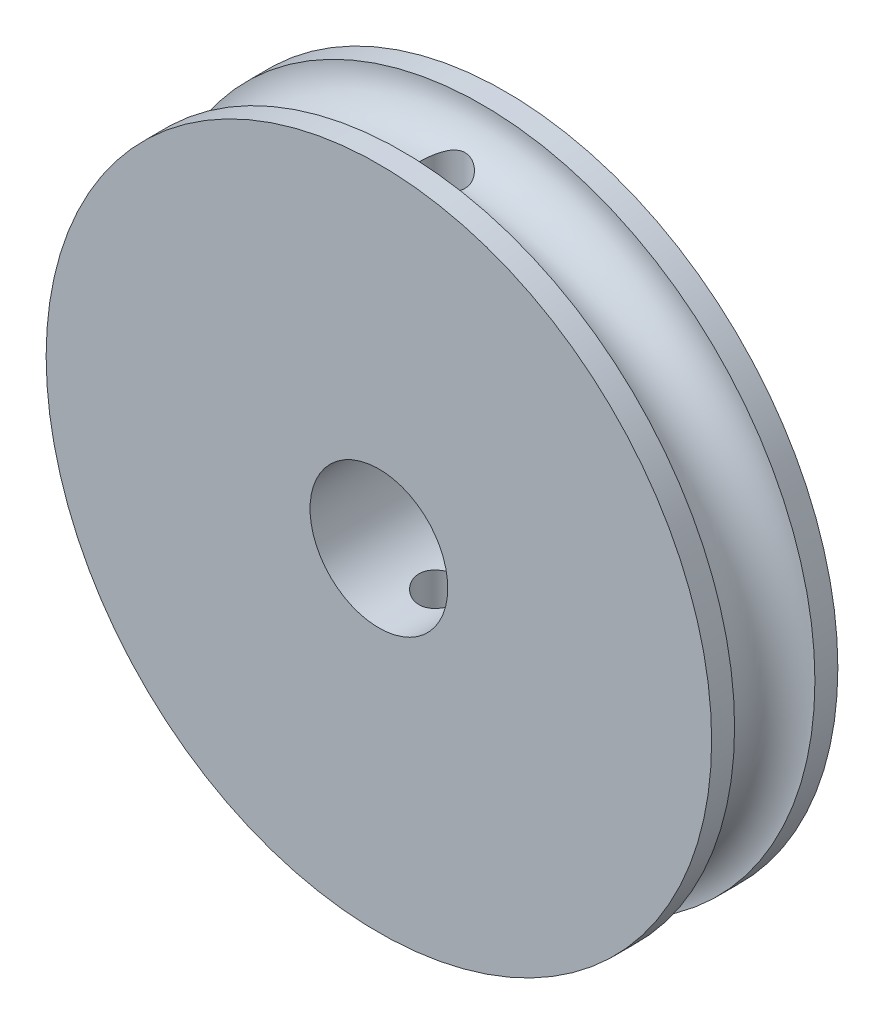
ISO-10303-21;
HEADER;
FILE_DESCRIPTION(('STEP AP214'),'2;1');
FILE_NAME('part.step','',(''),(''),'','','');
FILE_SCHEMA(('AUTOMOTIVE_DESIGN { 1 0 10303 214 1 1 1 1 }'));
ENDSEC;
DATA;
#1=APPLICATION_CONTEXT('core data for automotive mechanical design processes');
#2=APPLICATION_PROTOCOL_DEFINITION('international standard','automotive_design',2000,#1);
#3=PRODUCT_CONTEXT('',#1,'mechanical');
#4=PRODUCT('Part','Part','',(#3));
#5=PRODUCT_RELATED_PRODUCT_CATEGORY('part','',(#4));
#6=PRODUCT_DEFINITION_FORMATION('','',#4);
#7=PRODUCT_DEFINITION_CONTEXT('part definition',#1,'design');
#8=PRODUCT_DEFINITION('design','',#6,#7);
#9=PRODUCT_DEFINITION_SHAPE('','',#8);
#10=(LENGTH_UNIT() NAMED_UNIT(*) SI_UNIT(.MILLI.,.METRE.));
#11=(NAMED_UNIT(*) PLANE_ANGLE_UNIT() SI_UNIT($,.RADIAN.));
#12=(NAMED_UNIT(*) SI_UNIT($,.STERADIAN.) SOLID_ANGLE_UNIT());
#13=UNCERTAINTY_MEASURE_WITH_UNIT(LENGTH_MEASURE(1.E-05),#10,'distance_accuracy_value','');
#14=(GEOMETRIC_REPRESENTATION_CONTEXT(3) GLOBAL_UNCERTAINTY_ASSIGNED_CONTEXT((#13)) GLOBAL_UNIT_ASSIGNED_CONTEXT((#10,
#11,#12)) REPRESENTATION_CONTEXT('',''));
#15=CARTESIAN_POINT('',(0.,0.,0.));
#16=DIRECTION('',(0.,0.,1.));
#17=DIRECTION('',(1.,0.,0.));
#18=AXIS2_PLACEMENT_3D('',#15,#16,#17);
#19=CARTESIAN_POINT('',(0.,-14.5,2.75));
#20=DIRECTION('',(0.,1.,0.));
#21=DIRECTION('',(0.,0.,1.));
#22=AXIS2_PLACEMENT_3D('',#19,#20,#21);
#23=CYLINDRICAL_SURFACE('',#22,1.);
#24=CARTESIAN_POINT('',(-0.787959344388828,12.837738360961,2.13427270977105));
#25=CARTESIAN_POINT('',(-0.752155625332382,12.8571922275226,2.08845557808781));
#26=CARTESIAN_POINT('',(-0.712533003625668,12.8776655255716,2.04598242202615));
#27=CARTESIAN_POINT('',(-0.626420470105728,12.9185715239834,1.96835150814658));
#28=CARTESIAN_POINT('',(-0.579907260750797,12.9390038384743,1.93321958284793));
#29=CARTESIAN_POINT('',(-0.480481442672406,12.9775439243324,1.87102811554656));
#30=CARTESIAN_POINT('',(-0.427538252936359,12.9956396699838,1.84400945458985));
#31=CARTESIAN_POINT('',(-0.316463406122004,13.026650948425,1.79952570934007));
#32=CARTESIAN_POINT('',(-0.25835032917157,13.039584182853,1.7820279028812));
#33=CARTESIAN_POINT('',(-0.154707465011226,13.0553638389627,1.76102445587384));
#34=CARTESIAN_POINT('',(-0.109946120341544,13.059978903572,1.75503401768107));
#35=CARTESIAN_POINT('',(-0.0197905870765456,13.0644891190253,1.74917832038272));
#36=CARTESIAN_POINT('',(0.0256032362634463,13.0643868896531,1.7493096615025));
#37=CARTESIAN_POINT('',(0.11563531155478,13.0594795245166,1.75568365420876));
#38=CARTESIAN_POINT('',(0.160274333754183,13.0546795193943,1.76191963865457));
#39=CARTESIAN_POINT('',(0.247722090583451,13.0410174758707,1.7801378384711));
#40=CARTESIAN_POINT('',(0.290529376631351,13.0321522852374,1.79212451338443));
#41=CARTESIAN_POINT('',(0.375616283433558,13.0108138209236,1.82207190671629));
#42=CARTESIAN_POINT('',(0.417757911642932,12.9981797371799,1.84030587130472));
#43=CARTESIAN_POINT('',(0.498605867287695,12.9707407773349,1.8819772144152));
#44=CARTESIAN_POINT('',(0.537310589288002,12.9559348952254,1.90541700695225));
#45=CARTESIAN_POINT('',(0.61837527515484,12.9222174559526,1.96226191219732));
#46=CARTESIAN_POINT('',(0.659903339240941,12.9030792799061,1.99672319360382));
#47=CARTESIAN_POINT('',(0.737013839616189,12.8651248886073,2.07197585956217));
#48=CARTESIAN_POINT('',(0.772589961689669,12.846309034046,2.1127738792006));
#49=CARTESIAN_POINT('',(0.840322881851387,12.8088817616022,2.20462648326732));
#50=CARTESIAN_POINT('',(0.871767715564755,12.7904843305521,2.25630149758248));
#51=CARTESIAN_POINT('',(0.925181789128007,12.7583289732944,2.36564809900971));
#52=CARTESIAN_POINT('',(0.947163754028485,12.7445648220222,2.42331150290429));
#53=CARTESIAN_POINT('',(0.978367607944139,12.7247658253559,2.5359671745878));
#54=CARTESIAN_POINT('',(0.988763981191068,12.7180254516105,2.59050705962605));
#55=CARTESIAN_POINT('',(1.00033326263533,12.710515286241,2.70094517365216));
#56=CARTESIAN_POINT('',(1.00151526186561,12.7097396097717,2.75684200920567));
#57=CARTESIAN_POINT('',(0.995074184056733,12.7139300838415,2.86014755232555));
#58=CARTESIAN_POINT('',(0.988636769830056,12.7181231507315,2.90766875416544));
#59=CARTESIAN_POINT('',(0.969209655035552,12.7305920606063,3.00078855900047));
#60=CARTESIAN_POINT('',(0.956218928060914,12.7388685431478,3.04638685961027));
#61=CARTESIAN_POINT('',(0.923930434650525,12.7589834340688,3.1355511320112));
#62=CARTESIAN_POINT('',(0.904507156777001,12.7708923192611,3.17905514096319));
#63=CARTESIAN_POINT('',(0.860114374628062,12.7972492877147,3.26227947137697));
#64=CARTESIAN_POINT('',(0.835143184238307,12.811698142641,3.30199863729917));
#65=CARTESIAN_POINT('',(0.776298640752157,12.844307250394,3.38261112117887));
#66=CARTESIAN_POINT('',(0.741661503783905,12.8627024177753,3.42285184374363));
#67=CARTESIAN_POINT('',(0.666553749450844,12.899921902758,3.49733469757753));
#68=CARTESIAN_POINT('',(0.626074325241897,12.9187468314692,3.53156759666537));
#69=CARTESIAN_POINT('',(0.53460340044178,12.9573090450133,3.59719528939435));
#70=CARTESIAN_POINT('',(0.482932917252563,12.9768826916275,3.62775030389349));
#71=CARTESIAN_POINT('',(0.373778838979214,13.011675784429,3.67946995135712));
#72=CARTESIAN_POINT('',(0.316308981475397,13.0269052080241,3.70065616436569));
#73=CARTESIAN_POINT('',(0.213250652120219,13.0470749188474,3.72803333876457));
#74=CARTESIAN_POINT('',(0.168653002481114,13.0536840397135,3.73673025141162));
#75=CARTESIAN_POINT('',(0.0782657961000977,13.0622736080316,3.74796899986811));
#76=CARTESIAN_POINT('',(0.0324775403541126,13.0642589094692,3.75051729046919));
#77=CARTESIAN_POINT('',(-0.058998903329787,13.0633238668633,3.74930685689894));
#78=CARTESIAN_POINT('',(-0.104686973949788,13.0603993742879,3.74554279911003));
#79=CARTESIAN_POINT('',(-0.194632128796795,13.0500498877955,3.73193237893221));
#80=CARTESIAN_POINT('',(-0.238888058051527,13.0426213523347,3.72208123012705));
#81=CARTESIAN_POINT('',(-0.325374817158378,13.0240904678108,3.69667035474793));
#82=CARTESIAN_POINT('',(-0.367581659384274,13.0129529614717,3.68105583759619));
#83=CARTESIAN_POINT('',(-0.448907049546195,12.9881538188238,3.64468954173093));
#84=CARTESIAN_POINT('',(-0.488024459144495,12.9744912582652,3.62393588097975));
#85=CARTESIAN_POINT('',(-0.569876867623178,12.943027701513,3.57338955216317));
#86=CARTESIAN_POINT('',(-0.611902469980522,12.9249321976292,3.5426303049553));
#87=CARTESIAN_POINT('',(-0.690648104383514,12.8883959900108,3.47505280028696));
#88=CARTESIAN_POINT('',(-0.727362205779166,12.8699549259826,3.43822786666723));
#89=CARTESIAN_POINT('',(-0.799663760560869,12.8317561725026,3.35337769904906));
#90=CARTESIAN_POINT('',(-0.83436450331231,12.8121787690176,3.30450548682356));
#91=CARTESIAN_POINT('',(-0.894900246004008,12.7767931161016,3.20030466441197));
#92=CARTESIAN_POINT('',(-0.920742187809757,12.7609819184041,3.14498115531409));
#93=CARTESIAN_POINT('',(-0.960518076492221,12.7361782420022,3.03390322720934));
#94=CARTESIAN_POINT('',(-0.975234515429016,12.7267440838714,2.9785317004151));
#95=CARTESIAN_POINT('',(-0.994966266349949,12.7140234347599,2.86542892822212));
#96=CARTESIAN_POINT('',(-0.999995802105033,12.7107279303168,2.80770126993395));
#97=CARTESIAN_POINT('',(-1.00000355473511,12.7107203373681,2.70113859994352));
#98=CARTESIAN_POINT('',(-0.996403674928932,12.7130769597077,2.65229620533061));
#99=CARTESIAN_POINT('',(-0.982217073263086,12.7222529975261,2.55605343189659));
#100=CARTESIAN_POINT('',(-0.971627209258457,12.7290744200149,2.50865371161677));
#101=CARTESIAN_POINT('',(-0.944191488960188,12.7464023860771,2.41720426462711));
#102=CARTESIAN_POINT('',(-0.927436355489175,12.756855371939,2.37311660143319));
#103=CARTESIAN_POINT('',(-0.888315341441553,12.7805936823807,2.2884051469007));
#104=CARTESIAN_POINT('',(-0.865956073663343,12.7938756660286,2.24777734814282));
#105=CARTESIAN_POINT('',(-0.824486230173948,12.817600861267,2.18328206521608));
#106=CARTESIAN_POINT('',(-0.806748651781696,12.8275292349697,2.15831692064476));
#107=CARTESIAN_POINT('',(-0.787959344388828,12.837738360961,2.13427270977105));
#108=B_SPLINE_CURVE_WITH_KNOTS('',3,(#24,#25,#26,#27,#28,#29,#30,#31,#32,#33,#34,#35,#36,#37,
#38,#39,#40,#41,#42,#43,#44,#45,#46,#47,#48,#49,#50,#51,#52,#53,#54,#55,#56,#57,#58,#59,#60,#61,
#62,#63,#64,#65,#66,#67,#68,#69,#70,#71,#72,#73,#74,#75,#76,#77,#78,#79,#80,#81,#82,#83,#84,#85,
#86,#87,#88,#89,#90,#91,#92,#93,#94,#95,#96,#97,#98,#99,#100,#101,#102,#103,#104,#105,#106,
#107),.UNSPECIFIED.,.T.,.F.,(4,2,2,2,2,2,2,2,2,2,2,2,2,2,2,2,2,2,2,2,2,2,2,2,2,2,2,2,2,2,2,2,2,
2,2,2,2,2,2,2,2,4),(0.,0.183850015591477,0.368336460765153,0.553737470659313,0.738497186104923,
0.874073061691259,1.00957364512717,1.14492640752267,1.28038430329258,1.42274334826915,
1.5651685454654,1.73625580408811,1.90752342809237,2.09614877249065,2.28451966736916,
2.45128197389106,2.61787972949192,2.76162309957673,2.90538899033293,3.05214384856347,
3.19894336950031,3.36685420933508,3.53502085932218,3.72346246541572,3.91146772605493,
4.04862095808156,4.18563014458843,4.32275515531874,4.45998812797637,4.59856082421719,
4.73718434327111,4.90195560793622,5.06690945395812,5.25509217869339,5.44312710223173,
5.61623412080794,5.78908676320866,5.93545664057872,6.08189235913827,6.22625422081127,
6.37044653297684,6.46692853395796),.UNSPECIFIED.);
#109=CARTESIAN_POINT('',(-0.787959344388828,12.837738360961,2.13427270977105));
#110=VERTEX_POINT('',#109);
#111=EDGE_CURVE('E111',#110,#110,#108,.T.);
#112=ORIENTED_EDGE('',*,*,#111,.F.);
#113=EDGE_LOOP('',(#112));
#114=FACE_BOUND('',#113,.T.);
#115=CARTESIAN_POINT('',(0.,3.,3.75));
#116=CARTESIAN_POINT('',(-0.0545633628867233,3.00000015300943,3.75000025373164));
#117=CARTESIAN_POINT('',(-0.10912519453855,2.99849769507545,3.74551973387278));
#118=CARTESIAN_POINT('',(-0.216641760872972,2.99265210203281,3.72777089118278));
#119=CARTESIAN_POINT('',(-0.269596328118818,2.98830867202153,3.71450165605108));
#120=CARTESIAN_POINT('',(-0.372332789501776,2.97725307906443,3.67968075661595));
#121=CARTESIAN_POINT('',(-0.422119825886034,2.97054487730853,3.65814293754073));
#122=CARTESIAN_POINT('',(-0.517374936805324,2.95544445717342,3.60745882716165));
#123=CARTESIAN_POINT('',(-0.562842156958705,2.94705190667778,3.5783110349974));
#124=CARTESIAN_POINT('',(-0.649741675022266,2.92914094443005,3.51217419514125));
#125=CARTESIAN_POINT('',(-0.691003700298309,2.91959556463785,3.47496876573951));
#126=CARTESIAN_POINT('',(-0.766832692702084,2.90060314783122,3.39423284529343));
#127=CARTESIAN_POINT('',(-0.801398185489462,2.89115613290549,3.35070096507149));
#128=CARTESIAN_POINT('',(-0.863824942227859,2.87313332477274,3.25701488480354));
#129=CARTESIAN_POINT('',(-0.891464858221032,2.86459039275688,3.20670626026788));
#130=CARTESIAN_POINT('',(-0.937818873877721,2.84975305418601,3.10182390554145));
#131=CARTESIAN_POINT('',(-0.956535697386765,2.84345796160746,3.04725148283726));
#132=CARTESIAN_POINT('',(-0.983873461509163,2.83411303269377,2.93732677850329));
#133=CARTESIAN_POINT('',(-0.992813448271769,2.83096095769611,2.88206279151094));
#134=CARTESIAN_POINT('',(-1.00134112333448,2.82795656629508,2.77073624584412));
#135=CARTESIAN_POINT('',(-1.00093170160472,2.8281032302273,2.71467393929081));
#136=CARTESIAN_POINT('',(-0.991019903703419,2.8315901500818,2.60606336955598));
#137=CARTESIAN_POINT('',(-0.981933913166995,2.83478415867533,2.55347159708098));
#138=CARTESIAN_POINT('',(-0.955606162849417,2.84376657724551,2.45060658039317));
#139=CARTESIAN_POINT('',(-0.938363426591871,2.84955529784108,2.40033361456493));
#140=CARTESIAN_POINT('',(-0.895939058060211,2.86317911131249,2.30258725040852));
#141=CARTESIAN_POINT('',(-0.870634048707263,2.87104565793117,2.25517197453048));
#142=CARTESIAN_POINT('',(-0.812889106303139,2.88792558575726,2.16512909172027));
#143=CARTESIAN_POINT('',(-0.780447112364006,2.89693929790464,2.12250287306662));
#144=CARTESIAN_POINT('',(-0.707349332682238,2.91567329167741,2.04090840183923));
#145=CARTESIAN_POINT('',(-0.666353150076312,2.92540589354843,2.00224730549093));
#146=CARTESIAN_POINT('',(-0.578339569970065,2.94406938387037,1.9322687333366));
#147=CARTESIAN_POINT('',(-0.531321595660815,2.95300019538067,1.90095196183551));
#148=CARTESIAN_POINT('',(-0.431947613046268,2.96917107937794,1.84630369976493));
#149=CARTESIAN_POINT('',(-0.379543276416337,2.97639350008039,1.82305450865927));
#150=CARTESIAN_POINT('',(-0.271269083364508,2.98820567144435,1.78579682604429));
#151=CARTESIAN_POINT('',(-0.215400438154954,2.99279633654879,1.77178512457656));
#152=CARTESIAN_POINT('',(-0.104383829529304,2.99867627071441,1.75394433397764));
#153=CARTESIAN_POINT('',(-0.0493095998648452,3.00010001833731,1.74970019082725));
#154=CARTESIAN_POINT('',(0.0607750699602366,2.99988902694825,1.75033267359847));
#155=CARTESIAN_POINT('',(0.115785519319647,2.99825480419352,1.75520775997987));
#156=CARTESIAN_POINT('',(0.222519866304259,2.99220024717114,1.77361190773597));
#157=CARTESIAN_POINT('',(0.274292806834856,2.98786198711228,1.78688620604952));
#158=CARTESIAN_POINT('',(0.374855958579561,2.97691846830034,1.8213934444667));
#159=CARTESIAN_POINT('',(0.423645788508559,2.97031292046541,1.84262739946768));
#160=CARTESIAN_POINT('',(0.518288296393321,2.95528931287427,1.8930704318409));
#161=CARTESIAN_POINT('',(0.56402995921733,2.94682814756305,1.9224745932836));
#162=CARTESIAN_POINT('',(0.650064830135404,2.92905253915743,1.98819415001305));
#163=CARTESIAN_POINT('',(0.690356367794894,2.91973783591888,2.02451165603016));
#164=CARTESIAN_POINT('',(0.766252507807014,2.90076847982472,2.10497875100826));
#165=CARTESIAN_POINT('',(0.801560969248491,2.89111761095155,2.14940922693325));
#166=CARTESIAN_POINT('',(0.864257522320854,2.87299973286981,2.2437715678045));
#167=CARTESIAN_POINT('',(0.891645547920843,2.8645327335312,2.2937034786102));
#168=CARTESIAN_POINT('',(0.937596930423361,2.84982391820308,2.3976730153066));
#169=CARTESIAN_POINT('',(0.956178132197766,2.84357760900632,2.45170207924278));
#170=CARTESIAN_POINT('',(0.983894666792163,2.83410832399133,2.56237865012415));
#171=CARTESIAN_POINT('',(0.993034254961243,2.83088398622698,2.61902496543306));
#172=CARTESIAN_POINT('',(1.00127628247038,2.82797858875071,2.73019709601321));
#173=CARTESIAN_POINT('',(1.00087025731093,2.82812400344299,2.78468234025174));
#174=CARTESIAN_POINT('',(0.991242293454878,2.8315126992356,2.89276507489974));
#175=CARTESIAN_POINT('',(0.982020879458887,2.83475579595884,2.94636261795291));
#176=CARTESIAN_POINT('',(0.95537181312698,2.84384524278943,3.05013566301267));
#177=CARTESIAN_POINT('',(0.93810334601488,2.84964098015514,3.10035682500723));
#178=CARTESIAN_POINT('',(0.895979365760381,2.86316398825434,3.19722740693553));
#179=CARTESIAN_POINT('',(0.871122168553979,2.87089168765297,3.24387603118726));
#180=CARTESIAN_POINT('',(0.813260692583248,2.8878282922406,3.33448366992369));
#181=CARTESIAN_POINT('',(0.779948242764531,2.89708711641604,3.3782365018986));
#182=CARTESIAN_POINT('',(0.706642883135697,2.91583356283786,3.45968981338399));
#183=CARTESIAN_POINT('',(0.666648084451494,2.92532124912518,3.49738857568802));
#184=CARTESIAN_POINT('',(0.579241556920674,2.94390030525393,3.56714441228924));
#185=CARTESIAN_POINT('',(0.531601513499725,2.95296181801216,3.59892434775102));
#186=CARTESIAN_POINT('',(0.431357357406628,2.96925991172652,3.65399042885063));
#187=CARTESIAN_POINT('',(0.378754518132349,2.9764969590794,3.67727874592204));
#188=CARTESIAN_POINT('',(0.272493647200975,2.98805515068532,3.71372163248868));
#189=CARTESIAN_POINT('',(0.218987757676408,2.9924921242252,3.72728246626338));
#190=CARTESIAN_POINT('',(0.110320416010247,2.99846407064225,3.74542028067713));
#191=CARTESIAN_POINT('',(0.0551594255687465,2.99999984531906,3.74999974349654));
#192=CARTESIAN_POINT('',(0.,3.,3.75));
#193=B_SPLINE_CURVE_WITH_KNOTS('',3,(#115,#116,#117,#118,#119,#120,#121,#122,#123,#124,#125,
#126,#127,#128,#129,#130,#131,#132,#133,#134,#135,#136,#137,#138,#139,#140,#141,#142,#143,#144,
#145,#146,#147,#148,#149,#150,#151,#152,#153,#154,#155,#156,#157,#158,#159,#160,#161,#162,#163,
#164,#165,#166,#167,#168,#169,#170,#171,#172,#173,#174,#175,#176,#177,#178,#179,#180,#181,#182,
#183,#184,#185,#186,#187,#188,#189,#190,#191,#192),.UNSPECIFIED.,.T.,.F.,(4,2,2,2,2,2,2,2,2,2,2,
2,2,2,2,2,2,2,2,2,2,2,2,2,2,2,2,2,2,2,2,2,2,2,2,2,2,2,4),(0.,0.163487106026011,
0.326991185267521,0.490222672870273,0.6534863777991,0.82184684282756,0.990244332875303,
1.1634838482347,1.33667044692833,1.5040192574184,1.67131633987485,1.8309682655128,
1.99063930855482,2.15288171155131,2.31517102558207,2.48593305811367,2.65671145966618,
2.82918405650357,3.00159668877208,3.1665358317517,3.33144713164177,3.49158157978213,
3.65173645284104,3.81610399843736,3.98052180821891,4.15241022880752,4.32430008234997,
4.49584013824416,4.66730284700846,4.82995666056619,4.99260079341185,5.15215587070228,
5.31174638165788,5.47830066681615,5.64490211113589,5.81799660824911,5.99104681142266,
6.15636558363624,6.3216386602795),.UNSPECIFIED.);
#194=CARTESIAN_POINT('',(0.,3.,3.75));
#195=VERTEX_POINT('',#194);
#196=EDGE_CURVE('E110',#195,#195,#193,.T.);
#197=ORIENTED_EDGE('',*,*,#196,.T.);
#198=EDGE_LOOP('',(#197));
#199=FACE_BOUND('',#198,.T.);
#200=DIRECTION('',(0.,1.,0.));
#201=VECTOR('',#200,1.);
#202=CARTESIAN_POINT('',(-0.661437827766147,-14.5,2.));
#203=LINE('',#202,#201);
#204=CARTESIAN_POINT('',(-0.661437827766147,8.75,2.));
#205=VERTEX_POINT('',#204);
#206=CARTESIAN_POINT('',(-0.661437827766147,7.25,2.));
#207=VERTEX_POINT('',#206);
#208=EDGE_CURVE('E90',#205,#207,#203,.F.);
#209=ORIENTED_EDGE('',*,*,#208,.F.);
#210=CARTESIAN_POINT('',(0.,8.,2.75));
#211=DIRECTION('',(0.,0.707106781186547,0.707106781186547));
#212=DIRECTION('',(0.,0.707106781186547,-0.707106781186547));
#213=AXIS2_PLACEMENT_3D('',#210,#211,#212);
#214=ELLIPSE('',#213,1.4142135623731,1.);
#215=CARTESIAN_POINT('',(0.661437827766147,8.75,2.));
#216=VERTEX_POINT('',#215);
#217=EDGE_CURVE('E97',#205,#216,#214,.F.);
#218=ORIENTED_EDGE('',*,*,#217,.T.);
#219=DIRECTION('',(0.,1.,0.));
#220=VECTOR('',#219,1.);
#221=CARTESIAN_POINT('',(0.661437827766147,-14.5,2.));
#222=LINE('',#221,#220);
#223=CARTESIAN_POINT('',(0.661437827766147,7.25,2.));
#224=VERTEX_POINT('',#223);
#225=EDGE_CURVE('E100',#224,#216,#222,.T.);
#226=ORIENTED_EDGE('',*,*,#225,.F.);
#227=CARTESIAN_POINT('',(0.,8.,2.75));
#228=DIRECTION('',(0.,0.707106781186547,-0.707106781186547));
#229=DIRECTION('',(0.,0.707106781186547,0.707106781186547));
#230=AXIS2_PLACEMENT_3D('',#227,#228,#229);
#231=ELLIPSE('',#230,1.4142135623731,1.);
#232=EDGE_CURVE('E94',#224,#207,#231,.T.);
#233=ORIENTED_EDGE('',*,*,#232,.T.);
#234=EDGE_LOOP('',(#209,#218,#226,#233));
#235=FACE_BOUND('',#234,.T.);
#236=ADVANCED_FACE('F34',(#114,#199,#235),#23,.F.);
#237=CARTESIAN_POINT('',(0.,0.,5.5));
#238=DIRECTION('',(0.,0.,-1.));
#239=DIRECTION('',(-1.,0.,0.));
#240=AXIS2_PLACEMENT_3D('',#237,#238,#239);
#241=CYLINDRICAL_SURFACE('',#240,14.5);
#242=CARTESIAN_POINT('',(0.,0.,1.));
#243=DIRECTION('',(0.,0.,1.));
#244=DIRECTION('',(1.,0.,0.));
#245=AXIS2_PLACEMENT_3D('',#242,#243,#244);
#246=CIRCLE('',#245,14.5);
#247=CARTESIAN_POINT('',(14.5,0.,1.));
#248=VERTEX_POINT('',#247);
#249=EDGE_CURVE('E207',#248,#248,#246,.F.);
#250=ORIENTED_EDGE('',*,*,#249,.T.);
#251=EDGE_LOOP('',(#250));
#252=FACE_BOUND('',#251,.T.);
#253=CARTESIAN_POINT('',(0.,0.,0.));
#254=DIRECTION('',(0.,0.,1.));
#255=DIRECTION('',(1.,0.,0.));
#256=AXIS2_PLACEMENT_3D('',#253,#254,#255);
#257=CIRCLE('',#256,14.5);
#258=CARTESIAN_POINT('',(14.5,0.,0.));
#259=VERTEX_POINT('',#258);
#260=EDGE_CURVE('E201',#259,#259,#257,.T.);
#261=ORIENTED_EDGE('',*,*,#260,.T.);
#262=EDGE_LOOP('',(#261));
#263=FACE_BOUND('',#262,.T.);
#264=ADVANCED_FACE('F147',(#252,#263),#241,.T.);
#265=CARTESIAN_POINT('',(0.,0.,5.5));
#266=DIRECTION('',(0.,0.,1.));
#267=DIRECTION('',(1.,0.,0.));
#268=AXIS2_PLACEMENT_3D('',#265,#266,#267);
#269=PLANE('',#268);
#270=CARTESIAN_POINT('',(0.,0.,5.5));
#271=DIRECTION('',(0.,0.,1.));
#272=DIRECTION('',(1.,0.,0.));
#273=AXIS2_PLACEMENT_3D('',#270,#271,#272);
#274=CIRCLE('',#273,14.5);
#275=CARTESIAN_POINT('',(14.5,0.,5.5));
#276=VERTEX_POINT('',#275);
#277=EDGE_CURVE('E102',#276,#276,#274,.T.);
#278=ORIENTED_EDGE('',*,*,#277,.T.);
#279=EDGE_LOOP('',(#278));
#280=FACE_BOUND('',#279,.T.);
#281=CARTESIAN_POINT('',(0.,0.,5.5));
#282=DIRECTION('',(0.,0.,1.));
#283=DIRECTION('',(1.,0.,0.));
#284=AXIS2_PLACEMENT_3D('',#281,#282,#283);
#285=CIRCLE('',#284,3.);
#286=CARTESIAN_POINT('',(3.,0.,5.5));
#287=VERTEX_POINT('',#286);
#288=EDGE_CURVE('E206',#287,#287,#285,.T.);
#289=ORIENTED_EDGE('',*,*,#288,.F.);
#290=EDGE_LOOP('',(#289));
#291=FACE_BOUND('',#290,.T.);
#292=ADVANCED_FACE('F143',(#280,#291),#269,.T.);
#293=CARTESIAN_POINT('',(0.,0.,0.));
#294=DIRECTION('',(0.,0.,1.));
#295=DIRECTION('',(1.,0.,0.));
#296=AXIS2_PLACEMENT_3D('',#293,#294,#295);
#297=PLANE('',#296);
#298=CARTESIAN_POINT('',(0.,-8.,0.));
#299=DIRECTION('',(0.,0.,-1.));
#300=DIRECTION('',(1.,0.,0.));
#301=AXIS2_PLACEMENT_3D('',#298,#299,#300);
#302=CIRCLE('',#301,1.);
#303=CARTESIAN_POINT('',(1.,-8.,0.));
#304=VERTEX_POINT('',#303);
#305=EDGE_CURVE('E84',#304,#304,#302,.T.);
#306=ORIENTED_EDGE('',*,*,#305,.F.);
#307=EDGE_LOOP('',(#306));
#308=FACE_BOUND('',#307,.T.);
#309=CARTESIAN_POINT('',(0.,8.,0.));
#310=DIRECTION('',(0.,0.,-1.));
#311=DIRECTION('',(-1.,0.,0.));
#312=AXIS2_PLACEMENT_3D('',#309,#310,#311);
#313=CIRCLE('',#312,1.);
#314=CARTESIAN_POINT('',(-1.,8.,0.));
#315=VERTEX_POINT('',#314);
#316=EDGE_CURVE('E133',#315,#315,#313,.T.);
#317=ORIENTED_EDGE('',*,*,#316,.F.);
#318=EDGE_LOOP('',(#317));
#319=FACE_BOUND('',#318,.T.);
#320=ORIENTED_EDGE('',*,*,#260,.F.);
#321=EDGE_LOOP('',(#320));
#322=FACE_BOUND('',#321,.T.);
#323=CARTESIAN_POINT('',(0.,0.,0.));
#324=DIRECTION('',(0.,0.,1.));
#325=DIRECTION('',(1.,0.,0.));
#326=AXIS2_PLACEMENT_3D('',#323,#324,#325);
#327=CIRCLE('',#326,3.);
#328=CARTESIAN_POINT('',(3.,0.,0.));
#329=VERTEX_POINT('',#328);
#330=EDGE_CURVE('E204',#329,#329,#327,.T.);
#331=ORIENTED_EDGE('',*,*,#330,.T.);
#332=EDGE_LOOP('',(#331));
#333=FACE_BOUND('',#332,.T.);
#334=ADVANCED_FACE('F146',(#308,#319,#322,#333),#297,.F.);
#335=CARTESIAN_POINT('',(0.,0.,4.5));
#336=DIRECTION('',(0.,0.,-1.));
#337=DIRECTION('',(-1.,0.,0.));
#338=AXIS2_PLACEMENT_3D('',#335,#336,#337);
#339=CIRCLE('',#338,14.5);
#340=CARTESIAN_POINT('',(-14.5,0.,4.5));
#341=VERTEX_POINT('',#340);
#342=EDGE_CURVE('E211',#341,#341,#339,.F.);
#343=ORIENTED_EDGE('',*,*,#342,.T.);
#344=EDGE_LOOP('',(#343));
#345=FACE_BOUND('',#344,.T.);
#346=ORIENTED_EDGE('',*,*,#277,.F.);
#347=EDGE_LOOP('',(#346));
#348=FACE_BOUND('',#347,.T.);
#349=ADVANCED_FACE('F36',(#345,#348),#241,.T.);
#350=CARTESIAN_POINT('',(0.,0.,5.5));
#351=DIRECTION('',(0.,0.,-1.));
#352=DIRECTION('',(-1.,0.,0.));
#353=AXIS2_PLACEMENT_3D('',#350,#351,#352);
#354=CYLINDRICAL_SURFACE('',#353,3.);
#355=CARTESIAN_POINT('',(0.,-3.,3.75));
#356=CARTESIAN_POINT('',(0.0545633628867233,-3.00000015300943,3.75000025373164));
#357=CARTESIAN_POINT('',(0.10912519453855,-2.99849769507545,3.74551973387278));
#358=CARTESIAN_POINT('',(0.216641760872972,-2.99265210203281,3.72777089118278));
#359=CARTESIAN_POINT('',(0.269596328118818,-2.98830867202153,3.71450165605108));
#360=CARTESIAN_POINT('',(0.372332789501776,-2.97725307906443,3.67968075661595));
#361=CARTESIAN_POINT('',(0.422119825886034,-2.97054487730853,3.65814293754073));
#362=CARTESIAN_POINT('',(0.517374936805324,-2.95544445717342,3.60745882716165));
#363=CARTESIAN_POINT('',(0.562842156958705,-2.94705190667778,3.5783110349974));
#364=CARTESIAN_POINT('',(0.649741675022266,-2.92914094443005,3.51217419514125));
#365=CARTESIAN_POINT('',(0.691003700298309,-2.91959556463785,3.47496876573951));
#366=CARTESIAN_POINT('',(0.766832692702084,-2.90060314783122,3.39423284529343));
#367=CARTESIAN_POINT('',(0.801398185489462,-2.89115613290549,3.35070096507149));
#368=CARTESIAN_POINT('',(0.863824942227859,-2.87313332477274,3.25701488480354));
#369=CARTESIAN_POINT('',(0.891464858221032,-2.86459039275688,3.20670626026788));
#370=CARTESIAN_POINT('',(0.937818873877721,-2.84975305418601,3.10182390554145));
#371=CARTESIAN_POINT('',(0.956535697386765,-2.84345796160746,3.04725148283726));
#372=CARTESIAN_POINT('',(0.983873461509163,-2.83411303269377,2.93732677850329));
#373=CARTESIAN_POINT('',(0.992813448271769,-2.83096095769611,2.88206279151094));
#374=CARTESIAN_POINT('',(1.00134112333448,-2.82795656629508,2.77073624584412));
#375=CARTESIAN_POINT('',(1.00093170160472,-2.8281032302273,2.71467393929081));
#376=CARTESIAN_POINT('',(0.991019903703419,-2.8315901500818,2.60606336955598));
#377=CARTESIAN_POINT('',(0.981933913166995,-2.83478415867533,2.55347159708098));
#378=CARTESIAN_POINT('',(0.955606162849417,-2.84376657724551,2.45060658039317));
#379=CARTESIAN_POINT('',(0.938363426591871,-2.84955529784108,2.40033361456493));
#380=CARTESIAN_POINT('',(0.895939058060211,-2.86317911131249,2.30258725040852));
#381=CARTESIAN_POINT('',(0.870634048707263,-2.87104565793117,2.25517197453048));
#382=CARTESIAN_POINT('',(0.812889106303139,-2.88792558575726,2.16512909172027));
#383=CARTESIAN_POINT('',(0.780447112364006,-2.89693929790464,2.12250287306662));
#384=CARTESIAN_POINT('',(0.707349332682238,-2.91567329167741,2.04090840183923));
#385=CARTESIAN_POINT('',(0.666353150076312,-2.92540589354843,2.00224730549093));
#386=CARTESIAN_POINT('',(0.578339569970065,-2.94406938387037,1.9322687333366));
#387=CARTESIAN_POINT('',(0.531321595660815,-2.95300019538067,1.90095196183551));
#388=CARTESIAN_POINT('',(0.431947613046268,-2.96917107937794,1.84630369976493));
#389=CARTESIAN_POINT('',(0.379543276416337,-2.97639350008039,1.82305450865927));
#390=CARTESIAN_POINT('',(0.271269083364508,-2.98820567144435,1.78579682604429));
#391=CARTESIAN_POINT('',(0.215400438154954,-2.99279633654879,1.77178512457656));
#392=CARTESIAN_POINT('',(0.104383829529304,-2.99867627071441,1.75394433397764));
#393=CARTESIAN_POINT('',(0.0493095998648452,-3.00010001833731,1.74970019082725));
#394=CARTESIAN_POINT('',(-0.0607750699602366,-2.99988902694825,1.75033267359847));
#395=CARTESIAN_POINT('',(-0.115785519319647,-2.99825480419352,1.75520775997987));
#396=CARTESIAN_POINT('',(-0.222519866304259,-2.99220024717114,1.77361190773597));
#397=CARTESIAN_POINT('',(-0.274292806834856,-2.98786198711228,1.78688620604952));
#398=CARTESIAN_POINT('',(-0.374855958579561,-2.97691846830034,1.8213934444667));
#399=CARTESIAN_POINT('',(-0.423645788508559,-2.97031292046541,1.84262739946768));
#400=CARTESIAN_POINT('',(-0.518288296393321,-2.95528931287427,1.8930704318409));
#401=CARTESIAN_POINT('',(-0.56402995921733,-2.94682814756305,1.9224745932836));
#402=CARTESIAN_POINT('',(-0.650064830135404,-2.92905253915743,1.98819415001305));
#403=CARTESIAN_POINT('',(-0.690356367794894,-2.91973783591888,2.02451165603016));
#404=CARTESIAN_POINT('',(-0.766252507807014,-2.90076847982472,2.10497875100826));
#405=CARTESIAN_POINT('',(-0.801560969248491,-2.89111761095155,2.14940922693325));
#406=CARTESIAN_POINT('',(-0.864257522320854,-2.87299973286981,2.2437715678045));
#407=CARTESIAN_POINT('',(-0.891645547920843,-2.8645327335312,2.2937034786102));
#408=CARTESIAN_POINT('',(-0.937596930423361,-2.84982391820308,2.3976730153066));
#409=CARTESIAN_POINT('',(-0.956178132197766,-2.84357760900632,2.45170207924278));
#410=CARTESIAN_POINT('',(-0.983894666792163,-2.83410832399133,2.56237865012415));
#411=CARTESIAN_POINT('',(-0.993034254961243,-2.83088398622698,2.61902496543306));
#412=CARTESIAN_POINT('',(-1.00127628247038,-2.82797858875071,2.73019709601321));
#413=CARTESIAN_POINT('',(-1.00087025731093,-2.82812400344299,2.78468234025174));
#414=CARTESIAN_POINT('',(-0.991242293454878,-2.8315126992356,2.89276507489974));
#415=CARTESIAN_POINT('',(-0.982020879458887,-2.83475579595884,2.94636261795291));
#416=CARTESIAN_POINT('',(-0.95537181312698,-2.84384524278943,3.05013566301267));
#417=CARTESIAN_POINT('',(-0.93810334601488,-2.84964098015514,3.10035682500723));
#418=CARTESIAN_POINT('',(-0.895979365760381,-2.86316398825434,3.19722740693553));
#419=CARTESIAN_POINT('',(-0.871122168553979,-2.87089168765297,3.24387603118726));
#420=CARTESIAN_POINT('',(-0.813260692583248,-2.8878282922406,3.33448366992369));
#421=CARTESIAN_POINT('',(-0.779948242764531,-2.89708711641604,3.3782365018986));
#422=CARTESIAN_POINT('',(-0.706642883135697,-2.91583356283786,3.45968981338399));
#423=CARTESIAN_POINT('',(-0.666648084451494,-2.92532124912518,3.49738857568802));
#424=CARTESIAN_POINT('',(-0.579241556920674,-2.94390030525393,3.56714441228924));
#425=CARTESIAN_POINT('',(-0.531601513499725,-2.95296181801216,3.59892434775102));
#426=CARTESIAN_POINT('',(-0.431357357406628,-2.96925991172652,3.65399042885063));
#427=CARTESIAN_POINT('',(-0.378754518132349,-2.9764969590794,3.67727874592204));
#428=CARTESIAN_POINT('',(-0.272493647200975,-2.98805515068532,3.71372163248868));
#429=CARTESIAN_POINT('',(-0.218987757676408,-2.9924921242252,3.72728246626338));
#430=CARTESIAN_POINT('',(-0.110320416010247,-2.99846407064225,3.74542028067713));
#431=CARTESIAN_POINT('',(-0.0551594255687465,-2.99999984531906,3.74999974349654));
#432=CARTESIAN_POINT('',(0.,-3.,3.75));
#433=B_SPLINE_CURVE_WITH_KNOTS('',3,(#355,#356,#357,#358,#359,#360,#361,#362,#363,#364,#365,
#366,#367,#368,#369,#370,#371,#372,#373,#374,#375,#376,#377,#378,#379,#380,#381,#382,#383,#384,
#385,#386,#387,#388,#389,#390,#391,#392,#393,#394,#395,#396,#397,#398,#399,#400,#401,#402,#403,
#404,#405,#406,#407,#408,#409,#410,#411,#412,#413,#414,#415,#416,#417,#418,#419,#420,#421,#422,
#423,#424,#425,#426,#427,#428,#429,#430,#431,#432),.UNSPECIFIED.,.T.,.F.,(4,2,2,2,2,2,2,2,2,2,2,
2,2,2,2,2,2,2,2,2,2,2,2,2,2,2,2,2,2,2,2,2,2,2,2,2,2,2,4),(0.,0.163487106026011,
0.326991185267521,0.490222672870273,0.6534863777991,0.82184684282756,0.990244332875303,
1.1634838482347,1.33667044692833,1.5040192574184,1.67131633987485,1.8309682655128,
1.99063930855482,2.15288171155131,2.31517102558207,2.48593305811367,2.65671145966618,
2.82918405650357,3.00159668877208,3.1665358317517,3.33144713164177,3.49158157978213,
3.65173645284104,3.81610399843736,3.98052180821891,4.15241022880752,4.32430008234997,
4.49584013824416,4.66730284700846,4.82995666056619,4.99260079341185,5.15215587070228,
5.31174638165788,5.47830066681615,5.64490211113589,5.81799660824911,5.99104681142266,
6.15636558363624,6.3216386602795),.UNSPECIFIED.);
#434=CARTESIAN_POINT('',(0.,-3.,3.75));
#435=VERTEX_POINT('',#434);
#436=EDGE_CURVE('E132',#435,#435,#433,.T.);
#437=ORIENTED_EDGE('',*,*,#436,.F.);
#438=EDGE_LOOP('',(#437));
#439=FACE_BOUND('',#438,.T.);
#440=ORIENTED_EDGE('',*,*,#196,.F.);
#441=EDGE_LOOP('',(#440));
#442=FACE_BOUND('',#441,.T.);
#443=ORIENTED_EDGE('',*,*,#288,.T.);
#444=EDGE_LOOP('',(#443));
#445=FACE_BOUND('',#444,.T.);
#446=ORIENTED_EDGE('',*,*,#330,.F.);
#447=EDGE_LOOP('',(#446));
#448=FACE_BOUND('',#447,.T.);
#449=ADVANCED_FACE('F138',(#439,#442,#445,#448),#354,.F.);
#450=CARTESIAN_POINT('',(0.,0.,2.75));
#451=DIRECTION('',(0.,0.,-1.));
#452=DIRECTION('',(-1.,0.,0.));
#453=AXIS2_PLACEMENT_3D('',#450,#451,#452);
#454=TOROIDAL_SURFACE('',#453,14.5,1.75);
#455=CARTESIAN_POINT('',(-0.661430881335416,-12.9019207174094,1.99999387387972));
#456=CARTESIAN_POINT('',(-0.703163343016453,-12.8823011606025,2.03679791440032));
#457=CARTESIAN_POINT('',(-0.741814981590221,-12.8625619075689,2.07706772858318));
#458=CARTESIAN_POINT('',(-0.812275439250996,-12.8247081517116,2.16404269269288));
#459=CARTESIAN_POINT('',(-0.844070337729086,-12.8065969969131,2.21076062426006));
#460=CARTESIAN_POINT('',(-0.899897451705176,-12.7737521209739,2.31017021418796));
#461=CARTESIAN_POINT('',(-0.923881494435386,-12.7590395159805,2.36289633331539));
#462=CARTESIAN_POINT('',(-0.962551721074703,-12.7348933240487,2.47274700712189));
#463=CARTESIAN_POINT('',(-0.977255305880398,-12.7254498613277,2.52986310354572));
#464=CARTESIAN_POINT('',(-0.995250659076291,-12.71383088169,2.63957922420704));
#465=CARTESIAN_POINT('',(-0.999686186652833,-12.7109280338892,2.69191471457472));
#466=CARTESIAN_POINT('',(-1.00028112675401,-12.7105409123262,2.79665080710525));
#467=CARTESIAN_POINT('',(-0.996442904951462,-12.7130550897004,2.84905138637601));
#468=CARTESIAN_POINT('',(-0.98150161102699,-12.7227123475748,2.94718989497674));
#469=CARTESIAN_POINT('',(-0.971122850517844,-12.7293933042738,2.99308806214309));
#470=CARTESIAN_POINT('',(-0.944301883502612,-12.7463323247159,3.08236661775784));
#471=CARTESIAN_POINT('',(-0.927858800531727,-12.7565909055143,3.12574664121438));
#472=CARTESIAN_POINT('',(-0.888192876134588,-12.7806763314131,3.21208780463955));
#473=CARTESIAN_POINT('',(-0.864580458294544,-12.7947005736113,3.25481342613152));
#474=CARTESIAN_POINT('',(-0.811822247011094,-12.8248037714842,3.33590834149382));
#475=CARTESIAN_POINT('',(-0.782672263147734,-12.8408842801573,3.37427430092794));
#476=CARTESIAN_POINT('',(-0.714466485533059,-12.8765313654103,3.45185989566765));
#477=CARTESIAN_POINT('',(-0.674574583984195,-12.8962500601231,3.49027632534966));
#478=CARTESIAN_POINT('',(-0.588801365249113,-12.9350207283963,3.56016916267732));
#479=CARTESIAN_POINT('',(-0.542918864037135,-12.9540725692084,3.59164419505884));
#480=CARTESIAN_POINT('',(-0.45117854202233,-12.987446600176,3.64381246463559));
#481=CARTESIAN_POINT('',(-0.405890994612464,-13.0020594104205,3.66531752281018));
#482=CARTESIAN_POINT('',(-0.311678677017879,-13.0274932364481,3.70152306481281));
#483=CARTESIAN_POINT('',(-0.262758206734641,-13.0383186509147,3.71623144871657));
#484=CARTESIAN_POINT('',(-0.161914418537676,-13.0547197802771,3.73816187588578));
#485=CARTESIAN_POINT('',(-0.109969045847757,-13.0602499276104,3.74531899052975));
#486=CARTESIAN_POINT('',(-0.00532236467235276,-13.0649014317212,3.75135521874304));
#487=CARTESIAN_POINT('',(0.047378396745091,-13.0640272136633,3.75024004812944));
#488=CARTESIAN_POINT('',(0.144303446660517,-13.0566082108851,3.74056555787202));
#489=CARTESIAN_POINT('',(0.188700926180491,-13.0508556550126,3.73304564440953));
#490=CARTESIAN_POINT('',(0.275452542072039,-13.0354726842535,3.71234931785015));
#491=CARTESIAN_POINT('',(0.317805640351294,-13.0258403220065,3.69917006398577));
#492=CARTESIAN_POINT('',(0.402488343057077,-13.0029767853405,3.66662347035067));
#493=CARTESIAN_POINT('',(0.444625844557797,-12.989547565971,3.64690037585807));
#494=CARTESIAN_POINT('',(0.525265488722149,-12.9607189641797,3.60218818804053));
#495=CARTESIAN_POINT('',(0.563765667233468,-12.9453185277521,3.57719627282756));
#496=CARTESIAN_POINT('',(0.644254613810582,-12.9105083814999,3.51678415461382));
#497=CARTESIAN_POINT('',(0.685354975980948,-12.8909212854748,3.48027668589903));
#498=CARTESIAN_POINT('',(0.761236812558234,-12.852471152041,3.40079977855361));
#499=CARTESIAN_POINT('',(0.796012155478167,-12.8336088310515,3.35782414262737));
#500=CARTESIAN_POINT('',(0.860815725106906,-12.7970142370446,3.26241660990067));
#501=CARTESIAN_POINT('',(0.890268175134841,-12.7794824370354,3.20951024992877));
#502=CARTESIAN_POINT('',(0.939443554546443,-12.7494710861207,3.09805091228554));
#503=CARTESIAN_POINT('',(0.959181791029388,-12.7369835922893,3.03950699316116));
#504=CARTESIAN_POINT('',(0.985758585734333,-12.7199955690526,2.92661671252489));
#505=CARTESIAN_POINT('',(0.993939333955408,-12.7146685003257,2.87271237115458));
#506=CARTESIAN_POINT('',(1.00137957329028,-12.709828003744,2.76404459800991));
#507=CARTESIAN_POINT('',(1.00064587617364,-12.710310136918,2.70928185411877));
#508=CARTESIAN_POINT('',(0.990981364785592,-12.7165873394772,2.6077825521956));
#509=CARTESIAN_POINT('',(0.983087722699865,-12.7217100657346,2.56089911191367));
#510=CARTESIAN_POINT('',(0.960946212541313,-12.7358474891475,2.46927958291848));
#511=CARTESIAN_POINT('',(0.946697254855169,-12.744862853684,2.42454386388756));
#512=CARTESIAN_POINT('',(0.911767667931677,-12.7664382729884,2.33646250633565));
#513=CARTESIAN_POINT('',(0.890857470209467,-12.7791230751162,2.29323949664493));
#514=CARTESIAN_POINT('',(0.84350956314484,-12.806862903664,2.21078309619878));
#515=CARTESIAN_POINT('',(0.817069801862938,-12.821918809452,2.17155119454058));
#516=CARTESIAN_POINT('',(0.754917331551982,-12.8556944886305,2.09195937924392));
#517=CARTESIAN_POINT('',(0.718408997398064,-12.8746253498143,2.05230965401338));
#518=CARTESIAN_POINT('',(0.639487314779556,-12.9125603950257,1.97931790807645));
#519=CARTESIAN_POINT('',(0.597064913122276,-12.9315646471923,1.94598574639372));
#520=CARTESIAN_POINT('',(0.50209638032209,-12.9697158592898,1.88312314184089));
#521=CARTESIAN_POINT('',(0.448954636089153,-12.9886672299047,1.85436231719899));
#522=CARTESIAN_POINT('',(0.337076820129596,-13.0215657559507,1.80657415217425));
#523=CARTESIAN_POINT('',(0.278356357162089,-13.0355263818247,1.78752055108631));
#524=CARTESIAN_POINT('',(0.174043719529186,-13.052913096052,1.76424177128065));
#525=CARTESIAN_POINT('',(0.129347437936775,-13.0581899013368,1.75736522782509));
#526=CARTESIAN_POINT('',(0.0391448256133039,-13.0640476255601,1.74974481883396));
#527=CARTESIAN_POINT('',(-0.00636073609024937,-13.0646327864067,1.74899541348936));
#528=CARTESIAN_POINT('',(-0.0968243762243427,-13.0610292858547,1.75366815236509));
#529=CARTESIAN_POINT('',(-0.141782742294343,-13.0568432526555,1.75908689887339));
#530=CARTESIAN_POINT('',(-0.230013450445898,-13.0442643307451,1.77577504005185));
#531=CARTESIAN_POINT('',(-0.273283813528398,-13.03586665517,1.7870510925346));
#532=CARTESIAN_POINT('',(-0.358826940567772,-13.015452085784,1.81546664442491));
#533=CARTESIAN_POINT('',(-0.401000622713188,-13.0033107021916,1.83281113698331));
#534=CARTESIAN_POINT('',(-0.481981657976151,-12.9767498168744,1.8726576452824));
#535=CARTESIAN_POINT('',(-0.520791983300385,-12.9623323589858,1.89515504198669));
#536=CARTESIAN_POINT('',(-0.594135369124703,-12.9325952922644,1.94444213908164));
#537=CARTESIAN_POINT('',(-0.62872900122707,-12.9172947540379,1.97115394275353));
#538=CARTESIAN_POINT('',(-0.661430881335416,-12.9019207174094,1.99999387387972));
#539=B_SPLINE_CURVE_WITH_KNOTS('',3,(#455,#456,#457,#458,#459,#460,#461,#462,#463,#464,#465,
#466,#467,#468,#469,#470,#471,#472,#473,#474,#475,#476,#477,#478,#479,#480,#481,#482,#483,#484,
#485,#486,#487,#488,#489,#490,#491,#492,#493,#494,#495,#496,#497,#498,#499,#500,#501,#502,#503,
#504,#505,#506,#507,#508,#509,#510,#511,#512,#513,#514,#515,#516,#517,#518,#519,#520,#521,#522,
#523,#524,#525,#526,#527,#528,#529,#530,#531,#532,#533,#534,#535,#536,#537,#538),.UNSPECIFIED.,
.T.,.F.,(4,2,2,2,2,2,2,2,2,2,2,2,2,2,2,2,2,2,2,2,2,2,2,2,2,2,2,2,2,2,2,2,2,2,2,2,2,2,2,2,2,4),
(0.,0.176855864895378,0.354067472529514,0.532352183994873,0.710301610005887,0.867210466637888,
1.02407446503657,1.16604598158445,1.30803802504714,1.45982936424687,1.61173602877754,
1.7873770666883,1.96305287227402,2.11909608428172,2.27495746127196,2.43214833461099,
2.58923060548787,2.72482043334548,2.86047840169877,3.00523510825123,3.15006954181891,
3.32442475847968,3.4989481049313,3.68697988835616,3.87471442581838,4.03807227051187,
4.20130529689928,4.34411338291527,4.48694596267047,4.63535991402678,4.78382903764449,
4.95452205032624,5.12547928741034,5.31443369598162,5.50287417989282,5.63885680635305,
5.77471647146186,5.91050133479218,6.04644087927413,6.18750446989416,6.32844210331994,
6.46702772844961),.UNSPECIFIED.);
#540=CARTESIAN_POINT('',(-0.661430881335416,-12.9019207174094,1.99999387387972));
#541=VERTEX_POINT('',#540);
#542=EDGE_CURVE('E103',#541,#541,#539,.T.);
#543=ORIENTED_EDGE('',*,*,#542,.T.);
#544=EDGE_LOOP('',(#543));
#545=FACE_BOUND('',#544,.T.);
#546=ORIENTED_EDGE('',*,*,#111,.T.);
#547=EDGE_LOOP('',(#546));
#548=FACE_BOUND('',#547,.T.);
#549=ORIENTED_EDGE('',*,*,#342,.F.);
#550=EDGE_LOOP('',(#549));
#551=FACE_BOUND('',#550,.T.);
#552=ORIENTED_EDGE('',*,*,#249,.F.);
#553=EDGE_LOOP('',(#552));
#554=FACE_BOUND('',#553,.T.);
#555=ADVANCED_FACE('F115',(#545,#548,#551,#554),#454,.F.);
#556=CARTESIAN_POINT('',(0.,-8.,2.75));
#557=DIRECTION('',(0.,0.707106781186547,0.707106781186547));
#558=DIRECTION('',(0.,0.707106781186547,-0.707106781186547));
#559=AXIS2_PLACEMENT_3D('',#556,#557,#558);
#560=ELLIPSE('',#559,1.4142135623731,1.);
#561=CARTESIAN_POINT('',(-0.661437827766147,-7.25,2.));
#562=VERTEX_POINT('',#561);
#563=CARTESIAN_POINT('',(0.661437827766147,-7.25,2.));
#564=VERTEX_POINT('',#563);
#565=EDGE_CURVE('E81',#562,#564,#560,.F.);
#566=ORIENTED_EDGE('',*,*,#565,.T.);
#567=DIRECTION('',(0.,1.,0.));
#568=VECTOR('',#567,1.);
#569=CARTESIAN_POINT('',(0.661437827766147,-14.5,2.));
#570=LINE('',#569,#568);
#571=CARTESIAN_POINT('',(0.661437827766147,-8.75,2.));
#572=VERTEX_POINT('',#571);
#573=EDGE_CURVE('E11',#564,#572,#570,.F.);
#574=ORIENTED_EDGE('',*,*,#573,.T.);
#575=CARTESIAN_POINT('',(0.,-8.,2.75));
#576=DIRECTION('',(0.,0.707106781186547,-0.707106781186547));
#577=DIRECTION('',(0.,0.707106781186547,0.707106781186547));
#578=AXIS2_PLACEMENT_3D('',#575,#576,#577);
#579=ELLIPSE('',#578,1.4142135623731,1.);
#580=CARTESIAN_POINT('',(-0.661437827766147,-8.75,2.));
#581=VERTEX_POINT('',#580);
#582=EDGE_CURVE('E42',#572,#581,#579,.T.);
#583=ORIENTED_EDGE('',*,*,#582,.T.);
#584=DIRECTION('',(0.,1.,0.));
#585=VECTOR('',#584,1.);
#586=CARTESIAN_POINT('',(-0.661437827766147,-14.5,2.));
#587=LINE('',#586,#585);
#588=EDGE_CURVE('E88',#581,#562,#587,.T.);
#589=ORIENTED_EDGE('',*,*,#588,.T.);
#590=EDGE_LOOP('',(#566,#574,#583,#589));
#591=FACE_BOUND('',#590,.T.);
#592=ORIENTED_EDGE('',*,*,#436,.T.);
#593=EDGE_LOOP('',(#592));
#594=FACE_BOUND('',#593,.T.);
#595=ORIENTED_EDGE('',*,*,#542,.F.);
#596=EDGE_LOOP('',(#595));
#597=FACE_BOUND('',#596,.T.);
#598=ADVANCED_FACE('F86',(#591,#594,#597),#23,.F.);
#599=CARTESIAN_POINT('',(0.,8.,2.));
#600=DIRECTION('',(0.,0.,-1.));
#601=DIRECTION('',(-1.,0.,0.));
#602=AXIS2_PLACEMENT_3D('',#599,#600,#601);
#603=CYLINDRICAL_SURFACE('',#602,1.);
#604=ORIENTED_EDGE('',*,*,#316,.T.);
#605=EDGE_LOOP('',(#604));
#606=FACE_BOUND('',#605,.T.);
#607=CARTESIAN_POINT('',(0.,8.,2.));
#608=DIRECTION('',(0.,0.,-1.));
#609=DIRECTION('',(-1.,0.,0.));
#610=AXIS2_PLACEMENT_3D('',#607,#608,#609);
#611=CIRCLE('',#610,1.);
#612=EDGE_CURVE('E55',#216,#224,#611,.T.);
#613=ORIENTED_EDGE('',*,*,#612,.F.);
#614=ORIENTED_EDGE('',*,*,#217,.F.);
#615=EDGE_CURVE('E174',#207,#205,#611,.T.);
#616=ORIENTED_EDGE('',*,*,#615,.F.);
#617=ORIENTED_EDGE('',*,*,#232,.F.);
#618=EDGE_LOOP('',(#613,#614,#616,#617));
#619=FACE_BOUND('',#618,.T.);
#620=ADVANCED_FACE('F121',(#606,#619),#603,.F.);
#621=CARTESIAN_POINT('',(0.,8.,2.));
#622=DIRECTION('',(0.,0.,-1.));
#623=DIRECTION('',(-1.,0.,0.));
#624=AXIS2_PLACEMENT_3D('',#621,#622,#623);
#625=PLANE('',#624);
#626=ORIENTED_EDGE('',*,*,#208,.T.);
#627=ORIENTED_EDGE('',*,*,#615,.T.);
#628=EDGE_LOOP('',(#626,#627));
#629=FACE_BOUND('',#628,.T.);
#630=ADVANCED_FACE('F173',(#629),#625,.T.);
#631=ORIENTED_EDGE('',*,*,#225,.T.);
#632=ORIENTED_EDGE('',*,*,#612,.T.);
#633=EDGE_LOOP('',(#631,#632));
#634=FACE_BOUND('',#633,.T.);
#635=ADVANCED_FACE('F181',(#634),#625,.T.);
#636=CARTESIAN_POINT('',(0.,-8.,2.));
#637=DIRECTION('',(0.,0.,-1.));
#638=DIRECTION('',(-1.,0.,0.));
#639=AXIS2_PLACEMENT_3D('',#636,#637,#638);
#640=CYLINDRICAL_SURFACE('',#639,1.);
#641=ORIENTED_EDGE('',*,*,#305,.T.);
#642=EDGE_LOOP('',(#641));
#643=FACE_BOUND('',#642,.T.);
#644=CARTESIAN_POINT('',(0.,-8.,2.));
#645=DIRECTION('',(0.,0.,-1.));
#646=DIRECTION('',(1.,0.,0.));
#647=AXIS2_PLACEMENT_3D('',#644,#645,#646);
#648=CIRCLE('',#647,1.);
#649=EDGE_CURVE('E77',#564,#572,#648,.T.);
#650=ORIENTED_EDGE('',*,*,#649,.F.);
#651=ORIENTED_EDGE('',*,*,#565,.F.);
#652=EDGE_CURVE('E48',#581,#562,#648,.T.);
#653=ORIENTED_EDGE('',*,*,#652,.F.);
#654=ORIENTED_EDGE('',*,*,#582,.F.);
#655=EDGE_LOOP('',(#650,#651,#653,#654));
#656=FACE_BOUND('',#655,.T.);
#657=ADVANCED_FACE('F76',(#643,#656),#640,.F.);
#658=CARTESIAN_POINT('',(0.,-8.,2.));
#659=DIRECTION('',(0.,0.,1.));
#660=DIRECTION('',(1.,0.,0.));
#661=AXIS2_PLACEMENT_3D('',#658,#659,#660);
#662=PLANE('',#661);
#663=ORIENTED_EDGE('',*,*,#649,.T.);
#664=ORIENTED_EDGE('',*,*,#573,.F.);
#665=EDGE_LOOP('',(#663,#664));
#666=FACE_BOUND('',#665,.T.);
#667=ADVANCED_FACE('F83',(#666),#662,.F.);
#668=ORIENTED_EDGE('',*,*,#652,.T.);
#669=ORIENTED_EDGE('',*,*,#588,.F.);
#670=EDGE_LOOP('',(#668,#669));
#671=FACE_BOUND('',#670,.T.);
#672=ADVANCED_FACE('F187',(#671),#662,.F.);
#673=CLOSED_SHELL('',(#236,#264,#292,#334,#349,#449,#555,#598,#620,#630,#635,#657,#667,#672));
#674=MANIFOLD_SOLID_BREP('B2',#673);
#675=ADVANCED_BREP_SHAPE_REPRESENTATION('',(#18,#674),#14);
#676=SHAPE_DEFINITION_REPRESENTATION(#9,#675);
ENDSEC;
END-ISO-10303-21;
